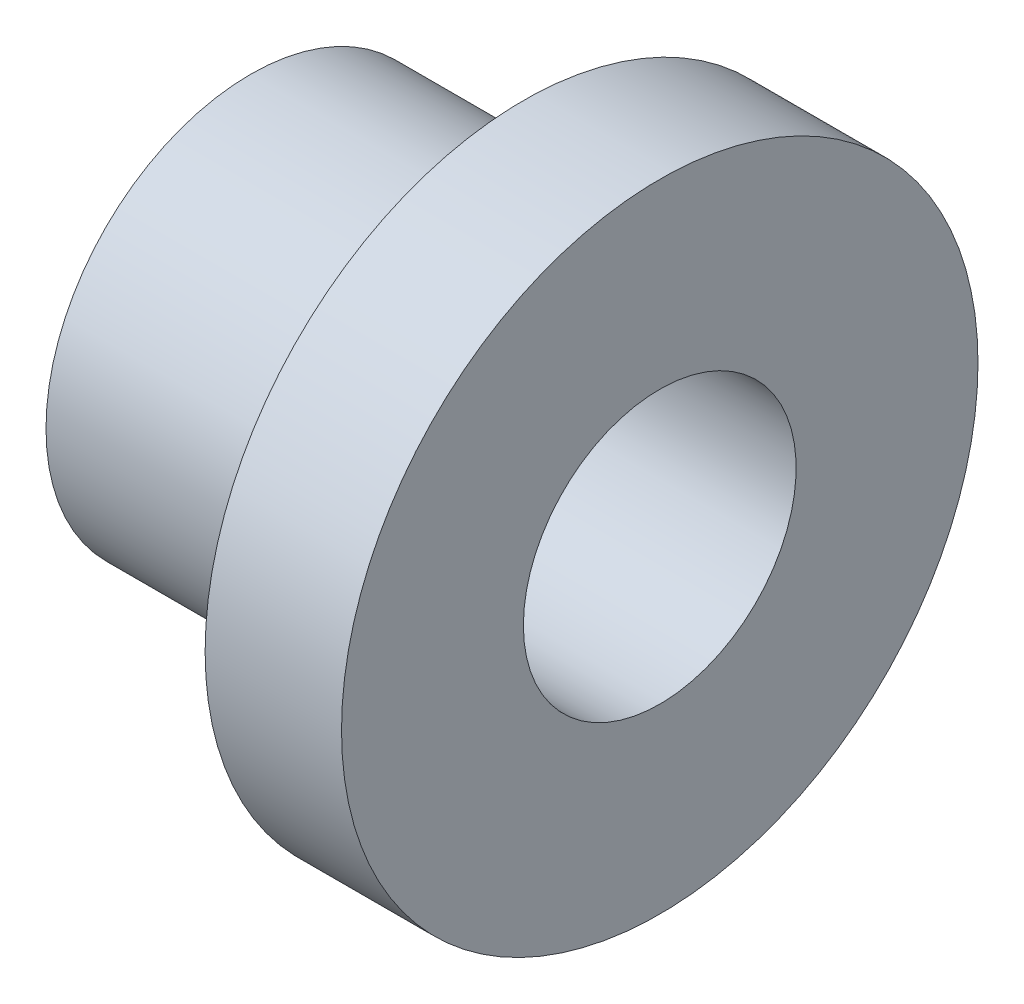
ISO-10303-21;
HEADER;
FILE_DESCRIPTION(('STEP AP214'),'2;1');
FILE_NAME('part.step','',(''),(''),'','','');
FILE_SCHEMA(('AUTOMOTIVE_DESIGN { 1 0 10303 214 1 1 1 1 }'));
ENDSEC;
DATA;
#1=APPLICATION_CONTEXT('core data for automotive mechanical design processes');
#2=APPLICATION_PROTOCOL_DEFINITION('international standard','automotive_design',2000,#1);
#3=PRODUCT_CONTEXT('',#1,'mechanical');
#4=PRODUCT('Part','Part','',(#3));
#5=PRODUCT_RELATED_PRODUCT_CATEGORY('part','',(#4));
#6=PRODUCT_DEFINITION_FORMATION('','',#4);
#7=PRODUCT_DEFINITION_CONTEXT('part definition',#1,'design');
#8=PRODUCT_DEFINITION('design','',#6,#7);
#9=PRODUCT_DEFINITION_SHAPE('','',#8);
#10=(LENGTH_UNIT() NAMED_UNIT(*) SI_UNIT(.MILLI.,.METRE.));
#11=(NAMED_UNIT(*) PLANE_ANGLE_UNIT() SI_UNIT($,.RADIAN.));
#12=(NAMED_UNIT(*) SI_UNIT($,.STERADIAN.) SOLID_ANGLE_UNIT());
#13=UNCERTAINTY_MEASURE_WITH_UNIT(LENGTH_MEASURE(1.E-05),#10,'distance_accuracy_value','');
#14=(GEOMETRIC_REPRESENTATION_CONTEXT(3) GLOBAL_UNCERTAINTY_ASSIGNED_CONTEXT((#13)) GLOBAL_UNIT_ASSIGNED_CONTEXT((#10,
#11,#12)) REPRESENTATION_CONTEXT('',''));
#15=CARTESIAN_POINT('',(0.,0.,0.));
#16=DIRECTION('',(0.,0.,1.));
#17=DIRECTION('',(1.,0.,0.));
#18=AXIS2_PLACEMENT_3D('',#15,#16,#17);
#19=CARTESIAN_POINT('',(0.,3.,0.));
#20=DIRECTION('',(1.,0.,0.));
#21=DIRECTION('',(0.,0.,-1.));
#22=AXIS2_PLACEMENT_3D('',#19,#20,#21);
#23=PLANE('',#22);
#24=CARTESIAN_POINT('',(0.,0.,0.));
#25=DIRECTION('',(-1.,0.,0.));
#26=DIRECTION('',(0.,0.,1.));
#27=AXIS2_PLACEMENT_3D('',#24,#25,#26);
#28=CIRCLE('',#27,3.);
#29=CARTESIAN_POINT('',(0.,0.,3.));
#30=VERTEX_POINT('',#29);
#31=EDGE_CURVE('E10',#30,#30,#28,.T.);
#32=ORIENTED_EDGE('',*,*,#31,.F.);
#33=EDGE_LOOP('',(#32));
#34=FACE_BOUND('',#33,.T.);
#35=CARTESIAN_POINT('',(0.,0.,0.));
#36=DIRECTION('',(-1.,0.,0.));
#37=DIRECTION('',(0.,0.,1.));
#38=AXIS2_PLACEMENT_3D('',#35,#36,#37);
#39=CIRCLE('',#38,4.5);
#40=CARTESIAN_POINT('',(0.,0.,4.5));
#41=VERTEX_POINT('',#40);
#42=EDGE_CURVE('E50',#41,#41,#39,.T.);
#43=ORIENTED_EDGE('',*,*,#42,.T.);
#44=EDGE_LOOP('',(#43));
#45=FACE_BOUND('',#44,.T.);
#46=ADVANCED_FACE('F28',(#34,#45),#23,.F.);
#47=CARTESIAN_POINT('',(0.,0.,0.));
#48=DIRECTION('',(-1.,0.,0.));
#49=DIRECTION('',(0.,0.,1.));
#50=AXIS2_PLACEMENT_3D('',#47,#48,#49);
#51=CYLINDRICAL_SURFACE('',#50,3.);
#52=CARTESIAN_POINT('',(9.,0.,0.));
#53=DIRECTION('',(-1.,0.,0.));
#54=DIRECTION('',(0.,0.,1.));
#55=AXIS2_PLACEMENT_3D('',#52,#53,#54);
#56=CIRCLE('',#55,3.);
#57=CARTESIAN_POINT('',(9.,0.,3.));
#58=VERTEX_POINT('',#57);
#59=EDGE_CURVE('E34',#58,#58,#56,.T.);
#60=ORIENTED_EDGE('',*,*,#59,.F.);
#61=EDGE_LOOP('',(#60));
#62=FACE_BOUND('',#61,.T.);
#63=ORIENTED_EDGE('',*,*,#31,.T.);
#64=EDGE_LOOP('',(#63));
#65=FACE_BOUND('',#64,.T.);
#66=ADVANCED_FACE('F75',(#62,#65),#51,.F.);
#67=CARTESIAN_POINT('',(9.,7.,0.));
#68=DIRECTION('',(-1.,0.,0.));
#69=DIRECTION('',(0.,0.,1.));
#70=AXIS2_PLACEMENT_3D('',#67,#68,#69);
#71=PLANE('',#70);
#72=CARTESIAN_POINT('',(9.,0.,0.));
#73=DIRECTION('',(-1.,0.,0.));
#74=DIRECTION('',(0.,0.,1.));
#75=AXIS2_PLACEMENT_3D('',#72,#73,#74);
#76=CIRCLE('',#75,7.);
#77=CARTESIAN_POINT('',(9.,0.,7.));
#78=VERTEX_POINT('',#77);
#79=EDGE_CURVE('E38',#78,#78,#76,.T.);
#80=ORIENTED_EDGE('',*,*,#79,.F.);
#81=EDGE_LOOP('',(#80));
#82=FACE_BOUND('',#81,.T.);
#83=ORIENTED_EDGE('',*,*,#59,.T.);
#84=EDGE_LOOP('',(#83));
#85=FACE_BOUND('',#84,.T.);
#86=ADVANCED_FACE('F70',(#82,#85),#71,.F.);
#87=CARTESIAN_POINT('',(0.,0.,0.));
#88=DIRECTION('',(-1.,0.,0.));
#89=DIRECTION('',(0.,0.,1.));
#90=AXIS2_PLACEMENT_3D('',#87,#88,#89);
#91=CYLINDRICAL_SURFACE('',#90,7.);
#92=CARTESIAN_POINT('',(6.,0.,0.));
#93=DIRECTION('',(-1.,0.,0.));
#94=DIRECTION('',(0.,0.,1.));
#95=AXIS2_PLACEMENT_3D('',#92,#93,#94);
#96=CIRCLE('',#95,7.);
#97=CARTESIAN_POINT('',(6.,0.,7.));
#98=VERTEX_POINT('',#97);
#99=EDGE_CURVE('E42',#98,#98,#96,.T.);
#100=ORIENTED_EDGE('',*,*,#99,.F.);
#101=EDGE_LOOP('',(#100));
#102=FACE_BOUND('',#101,.T.);
#103=ORIENTED_EDGE('',*,*,#79,.T.);
#104=EDGE_LOOP('',(#103));
#105=FACE_BOUND('',#104,.T.);
#106=ADVANCED_FACE('F64',(#102,#105),#91,.T.);
#107=CARTESIAN_POINT('',(6.,4.5,0.));
#108=DIRECTION('',(1.,0.,0.));
#109=DIRECTION('',(0.,0.,-1.));
#110=AXIS2_PLACEMENT_3D('',#107,#108,#109);
#111=PLANE('',#110);
#112=CARTESIAN_POINT('',(6.,0.,0.));
#113=DIRECTION('',(-1.,0.,0.));
#114=DIRECTION('',(0.,0.,1.));
#115=AXIS2_PLACEMENT_3D('',#112,#113,#114);
#116=CIRCLE('',#115,4.5);
#117=CARTESIAN_POINT('',(6.,0.,4.5));
#118=VERTEX_POINT('',#117);
#119=EDGE_CURVE('E47',#118,#118,#116,.T.);
#120=ORIENTED_EDGE('',*,*,#119,.F.);
#121=EDGE_LOOP('',(#120));
#122=FACE_BOUND('',#121,.T.);
#123=ORIENTED_EDGE('',*,*,#99,.T.);
#124=EDGE_LOOP('',(#123));
#125=FACE_BOUND('',#124,.T.);
#126=ADVANCED_FACE('F58',(#122,#125),#111,.F.);
#127=CARTESIAN_POINT('',(0.,0.,0.));
#128=DIRECTION('',(-1.,0.,0.));
#129=DIRECTION('',(0.,0.,1.));
#130=AXIS2_PLACEMENT_3D('',#127,#128,#129);
#131=CYLINDRICAL_SURFACE('',#130,4.5);
#132=ORIENTED_EDGE('',*,*,#42,.F.);
#133=EDGE_LOOP('',(#132));
#134=FACE_BOUND('',#133,.T.);
#135=ORIENTED_EDGE('',*,*,#119,.T.);
#136=EDGE_LOOP('',(#135));
#137=FACE_BOUND('',#136,.T.);
#138=ADVANCED_FACE('F55',(#134,#137),#131,.T.);
#139=CLOSED_SHELL('',(#46,#66,#86,#106,#126,#138));
#140=MANIFOLD_SOLID_BREP('B2',#139);
#141=ADVANCED_BREP_SHAPE_REPRESENTATION('',(#18,#140),#14);
#142=SHAPE_DEFINITION_REPRESENTATION(#9,#141);
ENDSEC;
END-ISO-10303-21;
